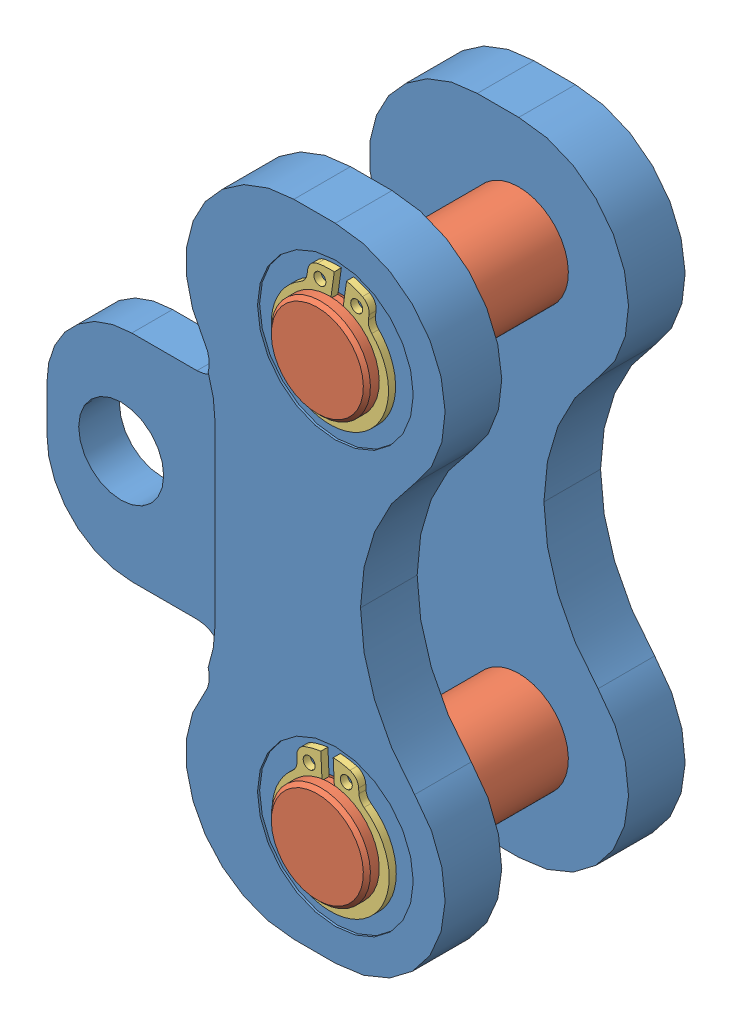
SolidWorks assembly s-ens_plaques_axes.SLDASM, configuration Défaut (file format 4400). Lengths in mm.
Overall size (58.5 90.5 39).
8 component instances, 3 part files, 16 mates.
Components (placement in the parent):
- plaque_articulation-1: plaque_articulation.SLDPRT [Défaut] at origin size (58.5 90.5 8)
- axe_machoire-1: axe_machoire.SLDPRT [Défaut] at (32.5 29.75 -28.45) x (0 0 1) z (-0.658293 0.752761 0) size (39 14 14)
- anneau_elastique_pour_arbre_14x1-1: anneau_elastique_pour_arbre_14x1.sldprt [Michaud Chailly F3-04-14] at (32.5 29.75 7.7) x (0 0 1) z (-0.990291 0.13901 0) size (1 18.96 16.55)
- axe_machoire-2: axe_machoire.SLDPRT [Défaut] at (32.5 -29.75 -28.45) x (0 0 1) z (-0.977092 -0.212817 0) size (39 14 14)
- anneau_elastique_pour_arbre_14x1-2: anneau_elastique_pour_arbre_14x1.sldprt [Michaud Chailly F3-04-14] at (32.5 -29.75 7.7) x (0 0 1) z (-0.998878 -0.047354 0) size (1 18.96 16.55)
- plaque_articulation-2: plaque_articulation.SLDPRT [Défaut] at (0 0 -17.9) x (1 0 0) z (0 0 -1) size (58.5 90.5 8)
- anneau_elastique_pour_arbre_14x1-3: anneau_elastique_pour_arbre_14x1.sldprt [Michaud Chailly F3-04-14] at (32.5 29.75 -25.6) x (0 0 -1) z (-0.050634 0.998717 0) size (1 18.96 16.55)
- anneau_elastique_pour_arbre_14x1-4: anneau_elastique_pour_arbre_14x1.sldprt [Michaud Chailly F3-04-14] at (32.5 -29.75 -26.7) x (0 0 1) z (-0.696746 -0.717318 0) size (1 18.96 16.55)
Mates (geometry in assembly coordinates):
- Coïncidente1: coordinate: point of plaque_articulation-1; point of assembly
- Coaxiale11: concentric aligned: cylinder of axe_machoire-1 through (32.5 29.75 -8.95) axis (0 0 -1) radius 7; cylinder of anneau_elastique_pour_arbre_14x1-1 through (32.5 29.75 8.7) axis (0 0 -1) radius 10.2
- Coïncidente2: coincident anti-aligned: plane of axe_machoire-1 through (37.5435 34.1606 7.7) normal (0 0 1); plane of anneau_elastique_pour_arbre_14x1-1 through (27.5108 37.9095 7.7) normal (0 0 -1)
- Coaxiale2: concentric anti-aligned: cylinder of plaque_articulation-1 through (32.5 29.75 8) axis (0 0 -1) radius 7; cylinder of axe_machoire-1 through (32.5 29.75 -8.95) axis (0 0 1) radius 7
- Coïncidente3: coincident anti-aligned: plane of plaque_articulation-1 through (32.5 29.75 7.7) normal (0 0 1); plane of anneau_elastique_pour_arbre_14x1-1 through (27.5108 37.9095 7.7) normal (0 0 -1)
- Coaxiale41: concentric aligned: cylinder of axe_machoire-2 through (32.5 -29.75 -8.95) axis (0 0 -1) radius 6.7; cylinder of anneau_elastique_pour_arbre_14x1-2 through (32.5 -29.75 8.7) axis (0 0 -1) radius 10.2
- Coïncidente41: coincident anti-aligned: plane of axe_machoire-2 through (31.0741 -23.2035 7.7) normal (0 0 1); plane of anneau_elastique_pour_arbre_14x1-2 through (26.082 -22.6593 7.7) normal (0 0 -1)
- Coaxiale5: concentric anti-aligned: cylinder of plaque_articulation-1 through (32.5 -29.75 8) axis (0 0 -1) radius 7; cylinder of axe_machoire-2 through (32.5 -29.75 -8.95) axis (0 0 1) radius 7
- Coïncidente5: coincident anti-aligned: plane of plaque_articulation-1 through (32.5 -29.75 7.7) normal (0 0 1); plane of anneau_elastique_pour_arbre_14x1-2 through (26.082 -22.6593 7.7) normal (0 0 -1)
- Coaxiale45: concentric aligned: cylinder of axe_machoire-1 through (32.5 29.75 -8.95) axis (0 0 1) radius 7; cylinder of plaque_articulation-2 through (32.5 29.75 -25.9) axis (0 0 1) radius 7
- Coaxiale46: concentric aligned: cylinder of axe_machoire-2 through (32.5 -29.75 -8.95) axis (0 0 1) radius 7; cylinder of plaque_articulation-2 through (32.5 -29.75 -25.9) axis (0 0 1) radius 7
- Coaxiale471: concentric aligned: cylinder of axe_machoire-1 through (32.5 29.75 -8.95) axis (0 0 1) radius 7; cylinder of anneau_elastique_pour_arbre_14x1-3 through (32.5 29.75 -26.6) axis (0 0 1) radius 10.2
- Coïncidente431: coincident anti-aligned: plane of axe_machoire-1 through (37.5435 34.1606 -25.6) normal (0 0 -1); plane of anneau_elastique_pour_arbre_14x1-3 through (24.8152 35.4432 -25.6) normal (0 0 1)
- Coaxiale481: concentric anti-aligned: cylinder of axe_machoire-2 through (32.5 -29.75 -8.95) axis (0 0 1) radius 7; cylinder of anneau_elastique_pour_arbre_14x1-4 through (32.5 -29.75 -25.7) axis (0 0 -1) radius 10.2
- Coïncidente441: coincident anti-aligned: plane of axe_machoire-2 through (31.0103 -22.9104 -26.7) normal (0 0 1); plane of anneau_elastique_pour_arbre_14x1-4 through (22.9687 -28.961 -26.7) normal (0 0 -1)
- Coïncidente45: coincident anti-aligned: plane of plaque_articulation-2 through (32.5 29.75 -25.6) normal (0 0 -1); plane of anneau_elastique_pour_arbre_14x1-3 through (24.8152 35.4432 -25.6) normal (0 0 1)
